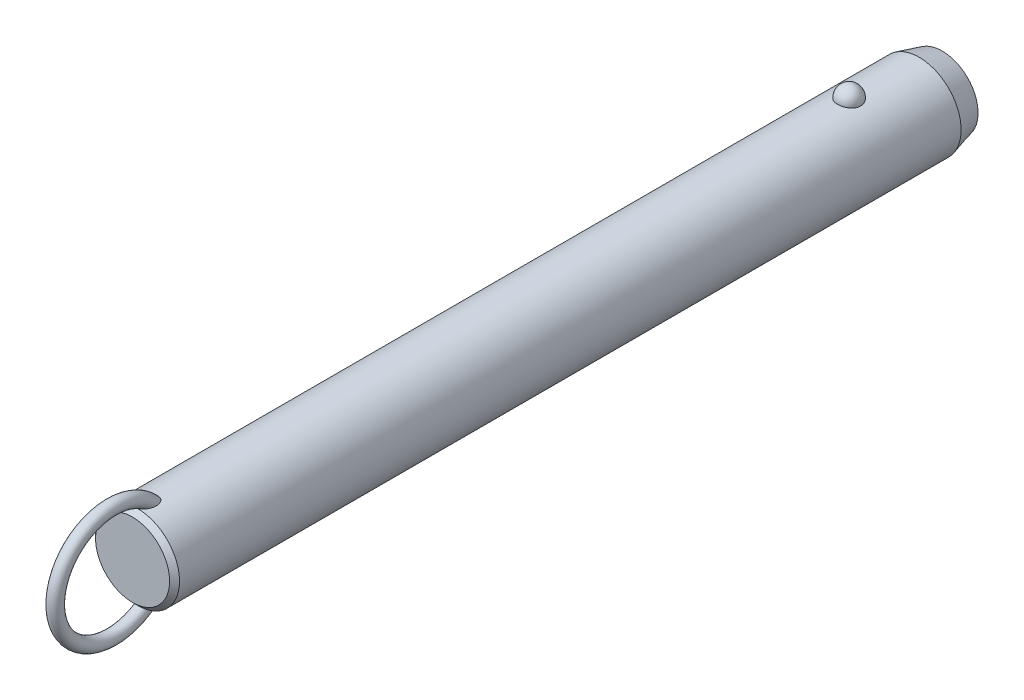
ISO-10303-21;
HEADER;
FILE_DESCRIPTION(('STEP AP214'),'2;1');
FILE_NAME('part.step','',(''),(''),'','','');
FILE_SCHEMA(('AUTOMOTIVE_DESIGN { 1 0 10303 214 1 1 1 1 }'));
ENDSEC;
DATA;
#1=APPLICATION_CONTEXT('core data for automotive mechanical design processes');
#2=APPLICATION_PROTOCOL_DEFINITION('international standard','automotive_design',2000,#1);
#3=PRODUCT_CONTEXT('',#1,'mechanical');
#4=PRODUCT('Part','Part','',(#3));
#5=PRODUCT_RELATED_PRODUCT_CATEGORY('part','',(#4));
#6=PRODUCT_DEFINITION_FORMATION('','',#4);
#7=PRODUCT_DEFINITION_CONTEXT('part definition',#1,'design');
#8=PRODUCT_DEFINITION('design','',#6,#7);
#9=PRODUCT_DEFINITION_SHAPE('','',#8);
#10=(LENGTH_UNIT() NAMED_UNIT(*) SI_UNIT(.MILLI.,.METRE.));
#11=(NAMED_UNIT(*) PLANE_ANGLE_UNIT() SI_UNIT($,.RADIAN.));
#12=(NAMED_UNIT(*) SI_UNIT($,.STERADIAN.) SOLID_ANGLE_UNIT());
#13=UNCERTAINTY_MEASURE_WITH_UNIT(LENGTH_MEASURE(1.E-05),#10,'distance_accuracy_value','');
#14=(GEOMETRIC_REPRESENTATION_CONTEXT(3) GLOBAL_UNCERTAINTY_ASSIGNED_CONTEXT((#13)) GLOBAL_UNIT_ASSIGNED_CONTEXT((#10,
#11,#12)) REPRESENTATION_CONTEXT('',''));
#15=CARTESIAN_POINT('',(0.,0.,0.));
#16=DIRECTION('',(0.,0.,1.));
#17=DIRECTION('',(1.,0.,0.));
#18=AXIS2_PLACEMENT_3D('',#15,#16,#17);
#19=CARTESIAN_POINT('',(0.,0.,200.6));
#20=DIRECTION('',(0.,0.,-1.));
#21=DIRECTION('',(-1.,0.,0.));
#22=AXIS2_PLACEMENT_3D('',#19,#20,#21);
#23=CYLINDRICAL_SURFACE('',#22,12.7);
#24=CARTESIAN_POINT('',(3.46661256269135,12.2177165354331,-3.5));
#25=CARTESIAN_POINT('',(3.4666090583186,12.2177194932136,-3.30432790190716));
#26=CARTESIAN_POINT('',(3.45063567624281,12.2222841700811,-3.10861112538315));
#27=CARTESIAN_POINT('',(3.38712451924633,12.2400345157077,-2.72271899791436));
#28=CARTESIAN_POINT('',(3.33957415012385,12.2532236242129,-2.53254588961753));
#29=CARTESIAN_POINT('',(3.2141234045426,12.286724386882,-2.16324948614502));
#30=CARTESIAN_POINT('',(3.13623639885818,12.3070329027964,-1.98412136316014));
#31=CARTESIAN_POINT('',(2.95205930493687,12.3525018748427,-1.64180592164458));
#32=CARTESIAN_POINT('',(2.84577003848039,12.3776621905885,-1.47861814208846));
#33=CARTESIAN_POINT('',(2.60688050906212,12.4301712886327,-1.17190583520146));
#34=CARTESIAN_POINT('',(2.47415697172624,12.4575299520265,-1.02847897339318));
#35=CARTESIAN_POINT('',(2.18615174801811,12.5112810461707,-0.766177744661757));
#36=CARTESIAN_POINT('',(2.03087002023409,12.5376734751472,-0.647303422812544));
#37=CARTESIAN_POINT('',(1.70237334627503,12.5864761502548,-0.437732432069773));
#38=CARTESIAN_POINT('',(1.52920948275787,12.6088972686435,-0.34695830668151));
#39=CARTESIAN_POINT('',(1.16944170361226,12.6473352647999,-0.195750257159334));
#40=CARTESIAN_POINT('',(0.982839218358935,12.663352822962,-0.135313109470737));
#41=CARTESIAN_POINT('',(0.604961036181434,12.6869706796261,-0.0473241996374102));
#42=CARTESIAN_POINT('',(0.413823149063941,12.6947125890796,-0.0192185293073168));
#43=CARTESIAN_POINT('',(0.0293827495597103,12.7014203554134,0.00517254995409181));
#44=CARTESIAN_POINT('',(-0.163919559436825,12.7003870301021,0.00146092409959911));
#45=CARTESIAN_POINT('',(-0.544374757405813,12.689735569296,-0.0373939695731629));
#46=CARTESIAN_POINT('',(-0.731575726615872,12.6802364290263,-0.0721015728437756));
#47=CARTESIAN_POINT('',(-1.09733277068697,12.6538333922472,-0.171364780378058));
#48=CARTESIAN_POINT('',(-1.27588869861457,12.6369293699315,-0.23592089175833));
#49=CARTESIAN_POINT('',(-1.6204698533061,12.5973946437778,-0.393548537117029));
#50=CARTESIAN_POINT('',(-1.78641865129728,12.5747321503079,-0.48677898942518));
#51=CARTESIAN_POINT('',(-2.10030671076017,12.5261316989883,-0.699110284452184));
#52=CARTESIAN_POINT('',(-2.24824419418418,12.5001934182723,-0.818213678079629));
#53=CARTESIAN_POINT('',(-2.52491489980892,12.4472906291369,-1.08157124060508));
#54=CARTESIAN_POINT('',(-2.65324222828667,12.4203160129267,-1.22624992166));
#55=CARTESIAN_POINT('',(-2.88410007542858,12.3687509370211,-1.53528325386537));
#56=CARTESIAN_POINT('',(-2.98662883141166,12.3441606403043,-1.69963924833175));
#57=CARTESIAN_POINT('',(-3.16432417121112,12.2998199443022,-2.04548497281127));
#58=CARTESIAN_POINT('',(-3.23917525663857,12.2801261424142,-2.22714424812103));
#59=CARTESIAN_POINT('',(-3.35800573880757,12.248167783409,-2.6009138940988));
#60=CARTESIAN_POINT('',(-3.4019860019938,12.2359030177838,-2.79302397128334));
#61=CARTESIAN_POINT('',(-3.45784812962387,12.2202347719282,-3.18140279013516));
#62=CARTESIAN_POINT('',(-3.46986123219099,12.2167950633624,-3.37765118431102));
#63=CARTESIAN_POINT('',(-3.46186273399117,12.2190638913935,-3.76943689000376));
#64=CARTESIAN_POINT('',(-3.44185196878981,12.2247721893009,-3.96497421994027));
#65=CARTESIAN_POINT('',(-3.37048652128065,12.2446381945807,-4.34881728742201));
#66=CARTESIAN_POINT('',(-3.31928253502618,12.2587552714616,-4.53715319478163));
#67=CARTESIAN_POINT('',(-3.18693461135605,12.2938237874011,-4.90231727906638));
#68=CARTESIAN_POINT('',(-3.1057895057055,12.3147754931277,-5.07914500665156));
#69=CARTESIAN_POINT('',(-2.91506431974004,12.3613125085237,-5.4173205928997));
#70=CARTESIAN_POINT('',(-2.80533587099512,12.3869217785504,-5.57858147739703));
#71=CARTESIAN_POINT('',(-2.560414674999,12.4398525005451,-5.88013283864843));
#72=CARTESIAN_POINT('',(-2.42522099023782,12.4671740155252,-6.02042254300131));
#73=CARTESIAN_POINT('',(-2.1323357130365,12.5205965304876,-6.27662798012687));
#74=CARTESIAN_POINT('',(-1.97456596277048,12.5466928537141,-6.39245542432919));
#75=CARTESIAN_POINT('',(-1.64115839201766,12.5946384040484,-6.59583547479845));
#76=CARTESIAN_POINT('',(-1.46552179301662,12.6164879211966,-6.68339001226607));
#77=CARTESIAN_POINT('',(-1.10356050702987,12.6532533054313,-6.82682153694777));
#78=CARTESIAN_POINT('',(-0.917391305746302,12.6682500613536,-6.88306988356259));
#79=CARTESIAN_POINT('',(-0.537836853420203,12.6900288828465,-6.96386887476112));
#80=CARTESIAN_POINT('',(-0.344452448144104,12.6968119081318,-6.9884232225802));
#81=CARTESIAN_POINT('',(0.0402577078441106,12.7013667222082,-7.00496469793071));
#82=CARTESIAN_POINT('',(0.231556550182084,12.6993008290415,-6.99753844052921));
#83=CARTESIAN_POINT('',(0.610105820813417,12.6867505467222,-6.95166366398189));
#84=CARTESIAN_POINT('',(0.797356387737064,12.6762664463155,-6.91321620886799));
#85=CARTESIAN_POINT('',(1.16186657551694,12.6480587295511,-6.80658431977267));
#86=CARTESIAN_POINT('',(1.33915951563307,12.6303611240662,-6.73850666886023));
#87=CARTESIAN_POINT('',(1.67968518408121,12.5896027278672,-6.57450875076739));
#88=CARTESIAN_POINT('',(1.84291705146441,12.5665416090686,-6.47858678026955));
#89=CARTESIAN_POINT('',(2.15340192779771,12.5171072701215,-6.25982455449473));
#90=CARTESIAN_POINT('',(2.30037831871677,12.4906895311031,-6.13660186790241));
#91=CARTESIAN_POINT('',(2.5717412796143,12.4376567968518,-5.86739587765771));
#92=CARTESIAN_POINT('',(2.69612388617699,12.4110417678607,-5.72140858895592));
#93=CARTESIAN_POINT('',(2.92107785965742,12.360051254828,-5.40794137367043));
#94=CARTESIAN_POINT('',(3.02121329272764,12.3357209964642,-5.24014110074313));
#95=CARTESIAN_POINT('',(3.19236291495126,12.2925446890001,-4.8896986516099));
#96=CARTESIAN_POINT('',(3.26338839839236,12.2736965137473,-4.70706226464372));
#97=CARTESIAN_POINT('',(3.36788038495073,12.245404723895,-4.35469510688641));
#98=CARTESIAN_POINT('',(3.40484026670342,12.2351018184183,-4.18605935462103));
#99=CARTESIAN_POINT('',(3.45420764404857,12.2212564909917,-3.84496058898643));
#100=CARTESIAN_POINT('',(3.46661565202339,12.2177139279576,-3.67249765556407));
#101=CARTESIAN_POINT('',(3.46661256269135,12.2177165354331,-3.5));
#102=B_SPLINE_CURVE_WITH_KNOTS('',3,(#24,#25,#26,#27,#28,#29,#30,#31,#32,#33,#34,#35,#36,#37,
#38,#39,#40,#41,#42,#43,#44,#45,#46,#47,#48,#49,#50,#51,#52,#53,#54,#55,#56,#57,#58,#59,#60,#61,
#62,#63,#64,#65,#66,#67,#68,#69,#70,#71,#72,#73,#74,#75,#76,#77,#78,#79,#80,#81,#82,#83,#84,#85,
#86,#87,#88,#89,#90,#91,#92,#93,#94,#95,#96,#97,#98,#99,#100,#101),.UNSPECIFIED.,.T.,.F.,(4,2,2,
2,2,2,2,2,2,2,2,2,2,2,2,2,2,2,2,2,2,2,2,2,2,2,2,2,2,2,2,2,2,2,2,2,2,2,4),(0.,0.586396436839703,
1.17302689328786,1.7593990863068,2.34575431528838,2.93491084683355,3.52406845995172,
4.1115873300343,4.69904375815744,5.2762784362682,5.85345931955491,6.42265312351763,
6.99185659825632,7.56427334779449,8.136746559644,8.71981013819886,9.3029135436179,
9.89247258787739,10.4820150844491,11.0691335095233,11.6562366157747,12.2405256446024,
12.8248374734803,13.412244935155,13.9996740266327,14.5891883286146,15.1786623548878,
15.7609861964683,16.3432419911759,16.914863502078,17.4864654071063,18.056024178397,
18.6256177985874,19.2037609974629,19.7820055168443,20.3699810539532,20.9577282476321,
21.4746855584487,21.9916320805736),.UNSPECIFIED.);
#103=CARTESIAN_POINT('',(3.46661256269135,12.2177165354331,-3.5));
#104=VERTEX_POINT('',#103);
#105=EDGE_CURVE('E41',#104,#104,#102,.T.);
#106=ORIENTED_EDGE('',*,*,#105,.T.);
#107=EDGE_LOOP('',(#106));
#108=FACE_BOUND('',#107,.T.);
#109=CARTESIAN_POINT('',(0.,0.,211.8));
#110=DIRECTION('',(0.,0.,1.));
#111=DIRECTION('',(1.,0.,0.));
#112=AXIS2_PLACEMENT_3D('',#109,#110,#111);
#113=CIRCLE('',#112,12.7);
#114=CARTESIAN_POINT('',(12.7,0.,211.8));
#115=VERTEX_POINT('',#114);
#116=EDGE_CURVE('E10',#115,#115,#113,.F.);
#117=ORIENTED_EDGE('',*,*,#116,.T.);
#118=EDGE_LOOP('',(#117));
#119=FACE_BOUND('',#118,.T.);
#120=CARTESIAN_POINT('',(-0.548122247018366,-12.6881662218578,205.543218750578));
#121=CARTESIAN_POINT('',(-0.648865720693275,-12.6838128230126,205.577926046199));
#122=CARTESIAN_POINT('',(-0.746398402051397,-12.6783867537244,205.622042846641));
#123=CARTESIAN_POINT('',(-0.932125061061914,-12.666091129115,205.726764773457));
#124=CARTESIAN_POINT('',(-1.02030388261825,-12.6592192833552,205.787396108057));
#125=CARTESIAN_POINT('',(-1.18487740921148,-12.6448747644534,205.921847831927));
#126=CARTESIAN_POINT('',(-1.26134296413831,-12.637406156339,205.995582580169));
#127=CARTESIAN_POINT('',(-1.4023120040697,-12.6225412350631,206.153604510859));
#128=CARTESIAN_POINT('',(-1.466814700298,-12.6151449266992,206.23789238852));
#129=CARTESIAN_POINT('',(-1.60714786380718,-12.5981718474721,206.449657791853));
#130=CARTESIAN_POINT('',(-1.67725126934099,-12.588900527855,206.580962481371));
#131=CARTESIAN_POINT('',(-1.79536591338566,-12.5725964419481,206.853247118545));
#132=CARTESIAN_POINT('',(-1.84333535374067,-12.5655679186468,206.994244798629));
#133=CARTESIAN_POINT('',(-1.93422576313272,-12.5519624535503,207.337645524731));
#134=CARTESIAN_POINT('',(-1.96788773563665,-12.5466298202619,207.542557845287));
#135=CARTESIAN_POINT('',(-1.9941399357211,-12.542463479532,207.851760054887));
#136=CARTESIAN_POINT('',(-1.99883864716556,-12.5417153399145,207.955298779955));
#137=CARTESIAN_POINT('',(-2.00078003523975,-12.5414074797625,208.16245124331));
#138=CARTESIAN_POINT('',(-1.99802449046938,-12.5418474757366,208.266064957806));
#139=CARTESIAN_POINT('',(-1.98336733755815,-12.5441750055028,208.51032076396));
#140=CARTESIAN_POINT('',(-1.96851430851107,-12.5465291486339,208.650780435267));
#141=CARTESIAN_POINT('',(-1.92707089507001,-12.5529612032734,208.929960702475));
#142=CARTESIAN_POINT('',(-1.90047458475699,-12.5570399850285,209.068680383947));
#143=CARTESIAN_POINT('',(-1.8361912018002,-12.5666008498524,209.34341135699));
#144=CARTESIAN_POINT('',(-1.79850828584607,-12.57208240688,209.479423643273));
#145=CARTESIAN_POINT('',(-1.71223796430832,-12.5841228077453,209.747842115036));
#146=CARTESIAN_POINT('',(-1.66365679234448,-12.5906810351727,209.880250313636));
#147=CARTESIAN_POINT('',(-1.5780450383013,-12.6016176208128,210.08548877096));
#148=CARTESIAN_POINT('',(-1.54477252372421,-12.6057501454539,210.159914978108));
#149=CARTESIAN_POINT('',(-1.47424480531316,-12.6141930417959,210.306839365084));
#150=CARTESIAN_POINT('',(-1.436990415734,-12.6185033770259,210.379337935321));
#151=CARTESIAN_POINT('',(-1.35825795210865,-12.6272207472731,210.521892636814));
#152=CARTESIAN_POINT('',(-1.31678520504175,-12.6316276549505,210.591951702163));
#153=CARTESIAN_POINT('',(-1.22917793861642,-12.6404532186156,210.729070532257));
#154=CARTESIAN_POINT('',(-1.18304514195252,-12.6448718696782,210.796131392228));
#155=CARTESIAN_POINT('',(-1.0724641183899,-12.6547893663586,210.943874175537));
#156=CARTESIAN_POINT('',(-1.00642239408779,-12.6602600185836,211.023384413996));
#157=CARTESIAN_POINT('',(-0.864441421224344,-12.6707460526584,211.173169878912));
#158=CARTESIAN_POINT('',(-0.788516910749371,-12.6757620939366,211.243458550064));
#159=CARTESIAN_POINT('',(-0.652215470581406,-12.6833591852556,211.348680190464));
#160=CARTESIAN_POINT('',(-0.594982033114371,-12.6861973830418,211.387624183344));
#161=CARTESIAN_POINT('',(-0.475269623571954,-12.6912445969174,211.456489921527));
#162=CARTESIAN_POINT('',(-0.412800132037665,-12.6934547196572,211.486427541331));
#163=CARTESIAN_POINT('',(-0.295749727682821,-12.6966636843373,211.52975652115));
#164=CARTESIAN_POINT('',(-0.241949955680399,-12.6978134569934,211.545218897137));
#165=CARTESIAN_POINT('',(-0.132508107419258,-12.6994261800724,211.566884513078));
#166=CARTESIAN_POINT('',(-0.0768679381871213,-12.6998898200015,211.573097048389));
#167=CARTESIAN_POINT('',(0.03476966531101,-12.7000752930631,211.575583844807));
#168=CARTESIAN_POINT('',(0.0907676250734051,-12.6997954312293,211.571835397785));
#169=CARTESIAN_POINT('',(0.201283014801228,-12.6985255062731,211.554788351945));
#170=CARTESIAN_POINT('',(0.255799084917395,-12.6975348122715,211.541481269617));
#171=CARTESIAN_POINT('',(0.376042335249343,-12.6946091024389,211.50203792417));
#172=CARTESIAN_POINT('',(0.440950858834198,-12.6924943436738,211.473449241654));
#173=CARTESIAN_POINT('',(0.565350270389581,-12.6875639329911,211.406323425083));
#174=CARTESIAN_POINT('',(0.624828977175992,-12.6847467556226,211.367764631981));
#175=CARTESIAN_POINT('',(0.774116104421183,-12.6767252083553,211.256949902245));
#176=CARTESIAN_POINT('',(0.859449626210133,-12.6711344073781,211.178760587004));
#177=CARTESIAN_POINT('',(1.01789440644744,-12.6593922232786,211.010943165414));
#178=CARTESIAN_POINT('',(1.09096902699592,-12.653239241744,210.921282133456));
#179=CARTESIAN_POINT('',(1.22268793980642,-12.6411674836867,210.740265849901));
#180=CARTESIAN_POINT('',(1.28193986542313,-12.6352572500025,210.649345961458));
#181=CARTESIAN_POINT('',(1.39259777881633,-12.6235401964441,210.462792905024));
#182=CARTESIAN_POINT('',(1.44399707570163,-12.6177334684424,210.367155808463));
#183=CARTESIAN_POINT('',(1.53972870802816,-12.6064093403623,210.172273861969));
#184=CARTESIAN_POINT('',(1.58405262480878,-12.6008922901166,210.073024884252));
#185=CARTESIAN_POINT('',(1.66600705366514,-12.5903187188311,209.871772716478));
#186=CARTESIAN_POINT('',(1.70363651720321,-12.5852622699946,209.769769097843));
#187=CARTESIAN_POINT('',(1.77545379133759,-12.5753406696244,209.554358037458));
#188=CARTESIAN_POINT('',(1.80903453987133,-12.5705328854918,209.440745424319));
#189=CARTESIAN_POINT('',(1.86844163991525,-12.5618400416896,209.211457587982));
#190=CARTESIAN_POINT('',(1.89426665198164,-12.5579551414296,209.095782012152));
#191=CARTESIAN_POINT('',(1.9378546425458,-12.5513030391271,208.863007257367));
#192=CARTESIAN_POINT('',(1.9556264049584,-12.5485346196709,208.745909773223));
#193=CARTESIAN_POINT('',(1.98264463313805,-12.5442934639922,208.510747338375));
#194=CARTESIAN_POINT('',(1.99189298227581,-12.5428204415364,208.39268260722));
#195=CARTESIAN_POINT('',(2.00416068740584,-12.540871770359,208.080622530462));
#196=CARTESIAN_POINT('',(1.99944433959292,-12.541631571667,207.886229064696));
#197=CARTESIAN_POINT('',(1.96113755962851,-12.5476846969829,207.500309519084));
#198=CARTESIAN_POINT('',(1.92758341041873,-12.5529723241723,207.308780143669));
#199=CARTESIAN_POINT('',(1.83934342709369,-12.5661532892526,206.982272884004));
#200=CARTESIAN_POINT('',(1.79215440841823,-12.5730485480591,206.84524997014));
#201=CARTESIAN_POINT('',(1.67676242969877,-12.588958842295,206.580445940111));
#202=CARTESIAN_POINT('',(1.60859050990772,-12.597970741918,206.452651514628));
#203=CARTESIAN_POINT('',(1.46583832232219,-12.6152829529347,206.235800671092));
#204=CARTESIAN_POINT('',(1.39525727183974,-12.6233659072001,206.14410500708));
#205=CARTESIAN_POINT('',(1.23992594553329,-12.6395676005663,205.973485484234));
#206=CARTESIAN_POINT('',(1.15517932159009,-12.6476863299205,205.894558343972));
#207=CARTESIAN_POINT('',(0.971995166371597,-12.6630846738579,205.752643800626));
#208=CARTESIAN_POINT('',(0.873456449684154,-12.6703572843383,205.689784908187));
#209=CARTESIAN_POINT('',(0.665847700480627,-12.6829569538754,205.584487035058));
#210=CARTESIAN_POINT('',(0.556784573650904,-12.688285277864,205.542034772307));
#211=CARTESIAN_POINT('',(0.347338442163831,-12.6956226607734,205.484443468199));
#212=CARTESIAN_POINT('',(0.247759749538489,-12.6979816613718,205.466399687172));
#213=CARTESIAN_POINT('',(0.0470218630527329,-12.7003077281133,205.448600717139));
#214=CARTESIAN_POINT('',(-0.0541350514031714,-12.7002779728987,205.448821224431));
#215=CARTESIAN_POINT('',(-0.221414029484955,-12.6982482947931,205.464363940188));
#216=CARTESIAN_POINT('',(-0.288055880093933,-12.6969033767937,205.474666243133));
#217=CARTESIAN_POINT('',(-0.419599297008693,-12.6932369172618,205.50313489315));
#218=CARTESIAN_POINT('',(-0.484501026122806,-12.6909154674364,205.521300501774));
#219=CARTESIAN_POINT('',(-0.548122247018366,-12.6881662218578,205.543218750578));
#220=B_SPLINE_CURVE_WITH_KNOTS('',3,(#120,#121,#122,#123,#124,#125,#126,#127,#128,#129,#130,
#131,#132,#133,#134,#135,#136,#137,#138,#139,#140,#141,#142,#143,#144,#145,#146,#147,#148,#149,
#150,#151,#152,#153,#154,#155,#156,#157,#158,#159,#160,#161,#162,#163,#164,#165,#166,#167,#168,
#169,#170,#171,#172,#173,#174,#175,#176,#177,#178,#179,#180,#181,#182,#183,#184,#185,#186,#187,
#188,#189,#190,#191,#192,#193,#194,#195,#196,#197,#198,#199,#200,#201,#202,#203,#204,#205,#206,
#207,#208,#209,#210,#211,#212,#213,#214,#215,#216,#217,#218,#219),.UNSPECIFIED.,.T.,.F.,(4,2,2,
2,2,2,2,2,2,2,2,2,2,2,2,2,2,2,2,2,2,2,2,2,2,2,2,2,2,2,2,2,2,2,2,2,2,2,2,2,2,2,2,2,2,2,2,2,2,4),
(0.,0.31964225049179,0.639794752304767,0.957927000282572,1.27608021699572,1.72100165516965,
2.16675988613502,2.78630021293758,3.09705782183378,3.40774128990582,3.83096358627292,
4.25439969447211,4.67767724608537,5.10071330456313,5.3455029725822,5.59024267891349,
5.83467707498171,6.07902143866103,6.38891080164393,6.69834321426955,6.90560910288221,
7.11250749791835,7.27977315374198,7.44687060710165,7.61434932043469,7.78197685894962,
7.99365544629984,8.20579780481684,8.55147335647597,8.89816429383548,9.22375138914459,
9.54961437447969,9.87586224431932,10.202161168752,10.557587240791,10.9130746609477,
11.2681734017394,11.6231936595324,12.2046601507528,12.7853961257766,13.219164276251,
13.6522938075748,13.9989174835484,14.3454519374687,14.6946768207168,15.0436740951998,
15.3457513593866,15.6474266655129,15.8493051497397,16.0511646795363),.UNSPECIFIED.);
#221=CARTESIAN_POINT('',(-0.548122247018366,-12.6881662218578,205.543218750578));
#222=VERTEX_POINT('',#221);
#223=EDGE_CURVE('E60',#222,#222,#220,.T.);
#224=ORIENTED_EDGE('',*,*,#223,.T.);
#225=EDGE_LOOP('',(#224));
#226=FACE_BOUND('',#225,.T.);
#227=CARTESIAN_POINT('',(-0.548122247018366,12.6881662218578,205.543218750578));
#228=CARTESIAN_POINT('',(-0.459436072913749,12.6919968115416,205.512673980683));
#229=CARTESIAN_POINT('',(-0.368189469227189,12.6949996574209,205.489391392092));
#230=CARTESIAN_POINT('',(-0.18302400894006,12.6990186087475,205.458406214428));
#231=CARTESIAN_POINT('',(-0.0891049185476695,12.7000345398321,205.450704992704));
#232=CARTESIAN_POINT('',(0.0987147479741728,12.6999636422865,205.451245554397));
#233=CARTESIAN_POINT('',(0.192615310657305,12.6988761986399,205.459492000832));
#234=CARTESIAN_POINT('',(0.377658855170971,12.6947211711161,205.491551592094));
#235=CARTESIAN_POINT('',(0.468801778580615,12.6916535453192,205.515365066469));
#236=CARTESIAN_POINT('',(0.645809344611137,12.6838788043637,205.57745651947));
#237=CARTESIAN_POINT('',(0.731679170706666,12.6791733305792,205.615720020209));
#238=CARTESIAN_POINT('',(0.896315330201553,12.6686004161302,205.705120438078));
#239=CARTESIAN_POINT('',(0.97508059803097,12.6627328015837,205.756259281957));
#240=CARTESIAN_POINT('',(1.12963655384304,12.6499161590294,205.87367820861));
#241=CARTESIAN_POINT('',(1.20478673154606,12.6429194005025,205.940792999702));
#242=CARTESIAN_POINT('',(1.34448241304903,12.6288282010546,206.08522507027));
#243=CARTESIAN_POINT('',(1.40902173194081,12.621733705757,206.162548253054));
#244=CARTESIAN_POINT('',(1.55208211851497,12.6050877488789,206.359247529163));
#245=CARTESIAN_POINT('',(1.62510490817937,12.5957546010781,206.482654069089));
#246=CARTESIAN_POINT('',(1.7501904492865,12.5789823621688,206.739769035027));
#247=CARTESIAN_POINT('',(1.8022137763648,12.5715468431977,206.873496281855));
#248=CARTESIAN_POINT('',(1.90309965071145,12.5567434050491,207.198351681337));
#249=CARTESIAN_POINT('',(1.94342317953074,12.5504515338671,207.392161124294));
#250=CARTESIAN_POINT('',(1.99332997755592,12.5426147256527,207.78378810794));
#251=CARTESIAN_POINT('',(2.00285305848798,12.5410790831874,207.981612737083));
#252=CARTESIAN_POINT('',(1.99678999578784,12.5420407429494,208.316642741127));
#253=CARTESIAN_POINT('',(1.98794117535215,12.5434564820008,208.454042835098));
#254=CARTESIAN_POINT('',(1.95865119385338,12.5480641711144,208.727639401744));
#255=CARTESIAN_POINT('',(1.93820436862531,12.5512569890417,208.863835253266));
#256=CARTESIAN_POINT('',(1.88647896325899,12.5591352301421,209.134249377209));
#257=CARTESIAN_POINT('',(1.85518800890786,12.5638223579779,209.268465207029));
#258=CARTESIAN_POINT('',(1.78217886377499,12.5743868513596,209.533936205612));
#259=CARTESIAN_POINT('',(1.74046509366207,12.5802637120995,209.665192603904));
#260=CARTESIAN_POINT('',(1.66024095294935,12.5910571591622,209.886085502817));
#261=CARTESIAN_POINT('',(1.62434772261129,12.5957535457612,209.976690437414));
#262=CARTESIAN_POINT('',(1.54709009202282,12.6054762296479,210.155512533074));
#263=CARTESIAN_POINT('',(1.50572681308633,12.6105024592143,210.243730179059));
#264=CARTESIAN_POINT('',(1.41728020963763,12.620748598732,210.416932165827));
#265=CARTESIAN_POINT('',(1.37021377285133,12.625967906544,210.501925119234));
#266=CARTESIAN_POINT('',(1.26969620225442,12.6364721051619,210.668007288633));
#267=CARTESIAN_POINT('',(1.21624929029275,12.6417569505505,210.749099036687));
#268=CARTESIAN_POINT('',(1.10304413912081,12.6521331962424,210.904702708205));
#269=CARTESIAN_POINT('',(1.04340936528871,12.657226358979,210.979303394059));
#270=CARTESIAN_POINT('',(0.915919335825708,12.667090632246,211.121324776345));
#271=CARTESIAN_POINT('',(0.84806456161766,12.6718617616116,211.18874589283));
#272=CARTESIAN_POINT('',(0.717035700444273,12.67987711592,211.300624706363));
#273=CARTESIAN_POINT('',(0.655526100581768,12.6832377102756,211.346997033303));
#274=CARTESIAN_POINT('',(0.525985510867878,12.6892676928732,211.429619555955));
#275=CARTESIAN_POINT('',(0.457969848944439,12.6919386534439,211.465892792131));
#276=CARTESIAN_POINT('',(0.334859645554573,12.695691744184,211.516657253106));
#277=CARTESIAN_POINT('',(0.281116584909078,12.6970073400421,211.534373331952));
#278=CARTESIAN_POINT('',(0.171425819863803,12.6989609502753,211.560642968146));
#279=CARTESIAN_POINT('',(0.115480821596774,12.699599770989,211.569207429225));
#280=CARTESIAN_POINT('',(0.00272618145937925,12.7001251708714,211.576253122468));
#281=CARTESIAN_POINT('',(-0.0540859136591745,12.7000089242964,211.574696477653));
#282=CARTESIAN_POINT('',(-0.166544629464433,12.6990328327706,211.561600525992));
#283=CARTESIAN_POINT('',(-0.222190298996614,12.6981724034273,211.550053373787));
#284=CARTESIAN_POINT('',(-0.342018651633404,12.695562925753,211.514912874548));
#285=CARTESIAN_POINT('',(-0.405606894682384,12.6936676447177,211.48933225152));
#286=CARTESIAN_POINT('',(-0.527815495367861,12.6891754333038,211.428311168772));
#287=CARTESIAN_POINT('',(-0.586425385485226,12.6865770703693,211.392850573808));
#288=CARTESIAN_POINT('',(-0.731842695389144,12.6792129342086,211.291496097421));
#289=CARTESIAN_POINT('',(-0.81470941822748,12.6740767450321,211.2200395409));
#290=CARTESIAN_POINT('',(-0.969101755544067,12.6632083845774,211.06589007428));
#291=CARTESIAN_POINT('',(-1.04059564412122,12.6574746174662,210.983166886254));
#292=CARTESIAN_POINT('',(-1.16981116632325,12.6461638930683,210.815809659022));
#293=CARTESIAN_POINT('',(-1.22811369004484,12.6405994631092,210.731616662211));
#294=CARTESIAN_POINT('',(-1.33743405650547,12.6295007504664,210.558579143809));
#295=CARTESIAN_POINT('',(-1.38844577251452,12.6239664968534,210.469730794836));
#296=CARTESIAN_POINT('',(-1.48400702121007,12.6130898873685,210.288389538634));
#297=CARTESIAN_POINT('',(-1.52854232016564,12.6077479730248,210.195889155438));
#298=CARTESIAN_POINT('',(-1.61150113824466,12.5974127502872,210.008160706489));
#299=CARTESIAN_POINT('',(-1.64992317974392,12.5924195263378,209.912931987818));
#300=CARTESIAN_POINT('',(-1.73468589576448,12.581070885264,209.68289362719));
#301=CARTESIAN_POINT('',(-1.77831261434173,12.5749388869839,209.547066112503));
#302=CARTESIAN_POINT('',(-1.85439734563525,12.5639437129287,209.272212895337));
#303=CARTESIAN_POINT('',(-1.88684994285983,12.5590811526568,209.133185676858));
#304=CARTESIAN_POINT('',(-1.94008483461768,12.550968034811,208.85309235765));
#305=CARTESIAN_POINT('',(-1.96088706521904,12.5477147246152,208.712030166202));
#306=CARTESIAN_POINT('',(-1.99000539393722,12.5431291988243,208.428668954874));
#307=CARTESIAN_POINT('',(-1.99832911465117,12.5417958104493,208.286370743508));
#308=CARTESIAN_POINT('',(-2.00166624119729,12.5412674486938,207.957627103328));
#309=CARTESIAN_POINT('',(-1.99178843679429,12.5428579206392,207.771088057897));
#310=CARTESIAN_POINT('',(-1.94455183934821,12.5502731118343,207.40162404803));
#311=CARTESIAN_POINT('',(-1.90724032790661,12.5560905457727,207.218693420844));
#312=CARTESIAN_POINT('',(-1.81330718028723,12.5699462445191,206.904848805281));
#313=CARTESIAN_POINT('',(-1.76338820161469,12.5771273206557,206.771910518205));
#314=CARTESIAN_POINT('',(-1.64305018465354,12.593414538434,206.515681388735));
#315=CARTESIAN_POINT('',(-1.57265346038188,12.6025185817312,206.392380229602));
#316=CARTESIAN_POINT('',(-1.42634956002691,12.6198178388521,206.183564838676));
#317=CARTESIAN_POINT('',(-1.35423772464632,12.6278405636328,206.095384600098));
#318=CARTESIAN_POINT('',(-1.19645664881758,12.6437632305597,205.932107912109));
#319=CARTESIAN_POINT('',(-1.1108053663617,12.6516633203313,205.856994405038));
#320=CARTESIAN_POINT('',(-0.947219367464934,12.6648319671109,205.737811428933));
#321=CARTESIAN_POINT('',(-0.871624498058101,12.670300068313,205.690541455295));
#322=CARTESIAN_POINT('',(-0.714161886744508,12.6801492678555,205.6077413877));
#323=CARTESIAN_POINT('',(-0.632295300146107,12.684530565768,205.57220913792));
#324=CARTESIAN_POINT('',(-0.548122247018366,12.6881662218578,205.543218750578));
#325=B_SPLINE_CURVE_WITH_KNOTS('',3,(#227,#228,#229,#230,#231,#232,#233,#234,#235,#236,#237,
#238,#239,#240,#241,#242,#243,#244,#245,#246,#247,#248,#249,#250,#251,#252,#253,#254,#255,#256,
#257,#258,#259,#260,#261,#262,#263,#264,#265,#266,#267,#268,#269,#270,#271,#272,#273,#274,#275,
#276,#277,#278,#279,#280,#281,#282,#283,#284,#285,#286,#287,#288,#289,#290,#291,#292,#293,#294,
#295,#296,#297,#298,#299,#300,#301,#302,#303,#304,#305,#306,#307,#308,#309,#310,#311,#312,#313,
#314,#315,#316,#317,#318,#319,#320,#321,#322,#323,#324),.UNSPECIFIED.,.T.,.F.,(4,2,2,2,2,2,2,2,
2,2,2,2,2,2,2,2,2,2,2,2,2,2,2,2,2,2,2,2,2,2,2,2,2,2,2,2,2,2,2,2,2,2,2,2,2,2,2,2,4),(0.,
0.281328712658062,0.562682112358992,0.844117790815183,1.12555942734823,1.40671982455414,
1.68792232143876,1.98972294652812,2.29169886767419,2.72039860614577,3.14989948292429,
3.74084916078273,4.33295293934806,4.74554109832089,5.15833092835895,5.57159335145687,
5.98468079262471,6.27722775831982,6.56971484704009,6.86135609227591,7.15280542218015,
7.43927407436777,7.72572595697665,7.95635862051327,8.18646071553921,8.35559393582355,
8.52452541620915,8.6940894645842,8.86378678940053,9.06834348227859,9.27332014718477,
9.60010414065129,9.92778432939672,10.2350252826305,10.5425229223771,10.8506864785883,
11.15892440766,11.5867893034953,12.0148612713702,12.4421984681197,12.8692745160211,
13.4279365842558,13.9856380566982,14.4107062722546,14.835313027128,15.1765567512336,
15.517351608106,15.7844129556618,16.051425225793),.UNSPECIFIED.);
#326=CARTESIAN_POINT('',(-0.548122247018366,12.6881662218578,205.543218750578));
#327=VERTEX_POINT('',#326);
#328=EDGE_CURVE('E67',#327,#327,#325,.T.);
#329=ORIENTED_EDGE('',*,*,#328,.T.);
#330=EDGE_LOOP('',(#329));
#331=FACE_BOUND('',#330,.T.);
#332=CARTESIAN_POINT('',(0.,0.,-24.6999999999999));
#333=DIRECTION('',(0.,0.,-1.));
#334=DIRECTION('',(-1.,0.,0.));
#335=AXIS2_PLACEMENT_3D('',#332,#333,#334);
#336=CIRCLE('',#335,12.7);
#337=CARTESIAN_POINT('',(-12.7,0.,-24.6999999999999));
#338=VERTEX_POINT('',#337);
#339=EDGE_CURVE('E57',#338,#338,#336,.F.);
#340=ORIENTED_EDGE('',*,*,#339,.T.);
#341=EDGE_LOOP('',(#340));
#342=FACE_BOUND('',#341,.T.);
#343=ADVANCED_FACE('F37',(#108,#119,#226,#331,#342),#23,.T.);
#344=CARTESIAN_POINT('',(0.,0.,-31.7));
#345=DIRECTION('',(0.,0.,-1.));
#346=DIRECTION('',(-1.,0.,0.));
#347=AXIS2_PLACEMENT_3D('',#344,#345,#346);
#348=PLANE('',#347);
#349=CARTESIAN_POINT('',(0.,0.,-31.7));
#350=DIRECTION('',(0.,0.,-1.));
#351=DIRECTION('',(-1.,0.,0.));
#352=AXIS2_PLACEMENT_3D('',#349,#350,#351);
#353=CIRCLE('',#352,10.8243556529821);
#354=CARTESIAN_POINT('',(-10.8243556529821,0.,-31.7));
#355=VERTEX_POINT('',#354);
#356=EDGE_CURVE('E66',#355,#355,#353,.T.);
#357=ORIENTED_EDGE('',*,*,#356,.T.);
#358=EDGE_LOOP('',(#357));
#359=FACE_BOUND('',#358,.T.);
#360=ADVANCED_FACE('F85',(#359),#348,.T.);
#361=CARTESIAN_POINT('',(0.,0.,-31.7));
#362=DIRECTION('',(0.,0.,1.));
#363=DIRECTION('',(1.,0.,0.));
#364=AXIS2_PLACEMENT_3D('',#361,#362,#363);
#365=CONICAL_SURFACE('',#364,10.8243556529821,0.261799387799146);
#366=ORIENTED_EDGE('',*,*,#339,.F.);
#367=EDGE_LOOP('',(#366));
#368=FACE_BOUND('',#367,.T.);
#369=ORIENTED_EDGE('',*,*,#356,.F.);
#370=EDGE_LOOP('',(#369));
#371=FACE_BOUND('',#370,.T.);
#372=ADVANCED_FACE('F83',(#368,#371),#365,.T.);
#373=CARTESIAN_POINT('',(0.,0.,213.3));
#374=DIRECTION('',(0.,0.,1.));
#375=DIRECTION('',(1.,0.,0.));
#376=AXIS2_PLACEMENT_3D('',#373,#374,#375);
#377=PLANE('',#376);
#378=CARTESIAN_POINT('',(0.,0.,213.3));
#379=DIRECTION('',(0.,0.,1.));
#380=DIRECTION('',(1.,0.,0.));
#381=AXIS2_PLACEMENT_3D('',#378,#379,#380);
#382=CIRCLE('',#381,11.2);
#383=CARTESIAN_POINT('',(11.2,0.,213.3));
#384=VERTEX_POINT('',#383);
#385=EDGE_CURVE('E50',#384,#384,#382,.T.);
#386=ORIENTED_EDGE('',*,*,#385,.T.);
#387=EDGE_LOOP('',(#386));
#388=FACE_BOUND('',#387,.T.);
#389=ADVANCED_FACE('F77',(#388),#377,.T.);
#390=CARTESIAN_POINT('',(0.,0.,219.65));
#391=DIRECTION('',(1.,0.,0.));
#392=DIRECTION('',(0.,0.,-1.));
#393=AXIS2_PLACEMENT_3D('',#390,#391,#392);
#394=TOROIDAL_SURFACE('',#393,17.05,2.);
#395=ORIENTED_EDGE('',*,*,#328,.F.);
#396=EDGE_LOOP('',(#395));
#397=FACE_BOUND('',#396,.T.);
#398=ORIENTED_EDGE('',*,*,#223,.F.);
#399=EDGE_LOOP('',(#398));
#400=FACE_BOUND('',#399,.T.);
#401=ADVANCED_FACE('F73',(#397,#400),#394,.T.);
#402=CARTESIAN_POINT('',(0.,0.,213.3));
#403=DIRECTION('',(0.,0.,-1.));
#404=DIRECTION('',(-1.,0.,0.));
#405=AXIS2_PLACEMENT_3D('',#402,#403,#404);
#406=CONICAL_SURFACE('',#405,11.2,0.785398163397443);
#407=ORIENTED_EDGE('',*,*,#116,.F.);
#408=EDGE_LOOP('',(#407));
#409=FACE_BOUND('',#408,.T.);
#410=ORIENTED_EDGE('',*,*,#385,.F.);
#411=EDGE_LOOP('',(#410));
#412=FACE_BOUND('',#411,.T.);
#413=ADVANCED_FACE('F39',(#409,#412),#406,.T.);
#414=CARTESIAN_POINT('',(0.,12.7,-3.5));
#415=DIRECTION('',(0.,1.,0.));
#416=DIRECTION('',(0.,0.,1.));
#417=AXIS2_PLACEMENT_3D('',#414,#415,#416);
#418=SPHERICAL_SURFACE('',#417,3.5);
#419=ORIENTED_EDGE('',*,*,#105,.F.);
#420=EDGE_LOOP('',(#419));
#421=FACE_BOUND('',#420,.T.);
#422=ADVANCED_FACE('F79',(#421),#418,.T.);
#423=CLOSED_SHELL('',(#343,#360,#372,#389,#401,#413,#422));
#424=MANIFOLD_SOLID_BREP('B2',#423);
#425=ADVANCED_BREP_SHAPE_REPRESENTATION('',(#18,#424),#14);
#426=SHAPE_DEFINITION_REPRESENTATION(#9,#425);
ENDSEC;
END-ISO-10303-21;
